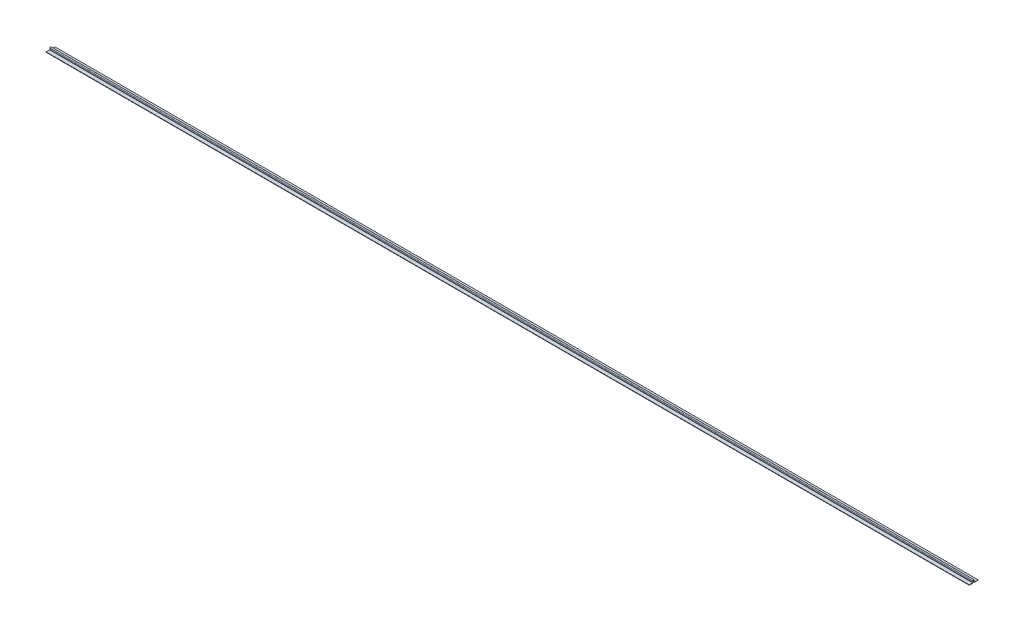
from build123d import *

# Parameters (mm, degrees)
BOSS_EXTRUDE1_DEPTH = 1227.5


with BuildPart() as part:
    # Sketch1 → Boss-Extrude1 (new, symmetric)
    with BuildSketch(Plane(origin=(0, 0, 0), x_dir=(0, 0, -1), z_dir=(1, 0, 0))):
        with BuildLine():
            Line((-1.75, 4), (-1.75, 0.5))
            ThreePointArc((-1.75, 0.5), (-1.896446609, 0.146446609), (-2.25, 0))
            Line((-2.25, 0), (-11.75, 0))
            Line((-11.75, 0), (-11.75, -1))
            Line((-11.75, -1), (-1.75, -1))
            ThreePointArc((-1.75, -1), (-1.042893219, -0.707106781), (-0.75, 0))
            Line((-0.75, 0), (-0.75, 0.5))
            Line((-0.75, 0.5), (-0.75, 4))
            ThreePointArc((-0.75, 4), (0, 4.75), (0.75, 4))
            Line((0.75, 4), (0.75, 0.5))
            Line((0.75, 0.5), (0.75, 0))
            ThreePointArc((0.75, 0), (1.042893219, -0.707106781), (1.75, -1))
            Line((1.75, -1), (11.75, -1))
            Line((11.75, -1), (11.75, 0))
            Line((11.75, 0), (2.25, 0))
            ThreePointArc((2.25, 0), (1.896446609, 0.146446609), (1.75, 0.5))
            Line((1.75, 0.5), (1.75, 4))
            ThreePointArc((1.75, 4), (0, 5.75), (-1.75, 4))
        make_face()
    extrude(amount=BOSS_EXTRUDE1_DEPTH, both=True)


solid = part.part
